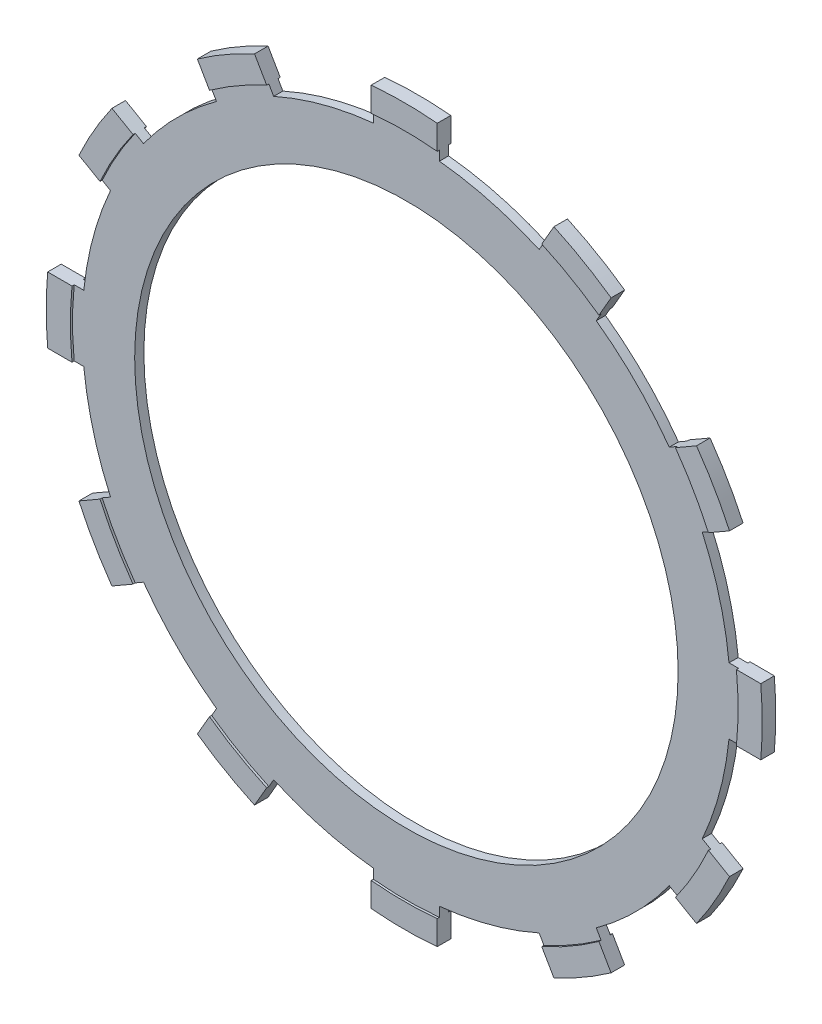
from build123d import *

# Parameters (mm, degrees)
SKETCH_1_R               = 66.95
SKETCH_1_R_2             = 56.1
EXTRUDE_1_DEPTH          = 1.9
EXTRUDE_2_DEPTH          = 1.9
EXTRUDE_START            = -2.35
EXTRUDE_3_DEPTH          = 2.8
PATTERN_CIRCULAR_1_COUNT = 12


with BuildPart() as part:
    # Sketch 1 → Extrude 1 (new body)
    with BuildSketch(Plane.XY):
        with Locations(Location((0, 0, 0), (0, 0, 180))):
            Circle(SKETCH_1_R)
        with Locations(Location((0, 0, 0), (0, 0, 180))):
            Circle(SKETCH_1_R_2, mode=Mode.SUBTRACT)
    extrude(amount=EXTRUDE_1_DEPTH)

    # Sketch 2 → Extrude 2 (add)
    with BuildSketch(Plane.XY):
        with BuildLine():
            Line((-6.815, 66.602239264), (-6.815, 73.610199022))
            ThreePointArc((-6.815, 73.610199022), (0, 73.925), (6.815, 73.610199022))
            Line((6.815, 73.610199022), (6.815, 66.602239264))
            ThreePointArc((6.815, 66.602239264), (0, 66.95), (-6.815, 66.602239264))
        make_face()
    extrude_2 = extrude(amount=EXTRUDE_2_DEPTH)

    # Sketch 3 → Extrude 3 (add)
    with BuildSketch(Plane.XY.offset(1.9).offset(EXTRUDE_START)):
        with BuildLine():
            Line((-6.815, 73.610199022), (-6.815, 68.587253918))
            ThreePointArc((-6.815, 68.587253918), (0, 68.925), (6.815, 68.587253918))
            Line((6.815, 68.587253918), (6.815, 73.610199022))
            ThreePointArc((6.815, 73.610199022), (0, 73.925), (-6.815, 73.610199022))
        make_face()
    extrude_3 = extrude(amount=EXTRUDE_3_DEPTH)

    # Pattern Circular 1: Extrude 2, Extrude 3 ×12 about axis
    pattern_circular_1_axis = Axis((0, 0, 0), (0, 0, 1))
    add([extrude_2.rotate(pattern_circular_1_axis, i * 360 / PATTERN_CIRCULAR_1_COUNT) for i in range(1, PATTERN_CIRCULAR_1_COUNT)])
    add([extrude_3.rotate(pattern_circular_1_axis, i * 360 / PATTERN_CIRCULAR_1_COUNT) for i in range(1, PATTERN_CIRCULAR_1_COUNT)])


solid = part.part
